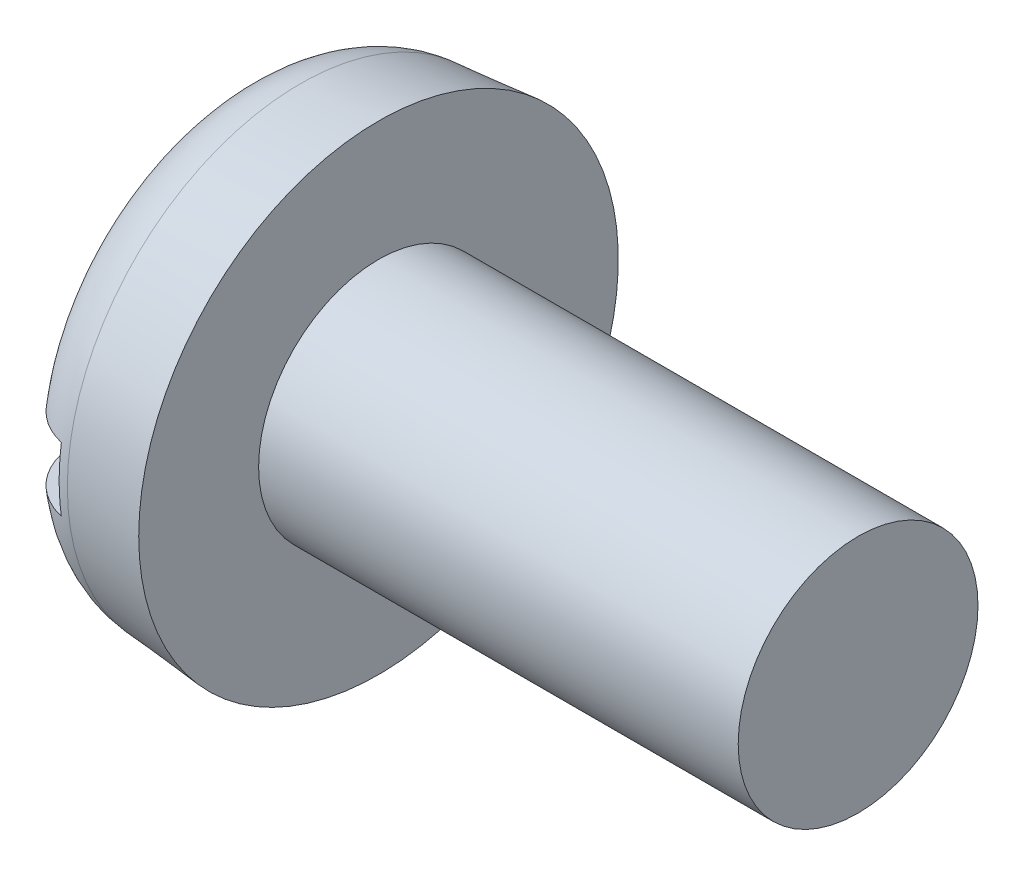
ISO-10303-21;
HEADER;
FILE_DESCRIPTION(('STEP AP214'),'2;1');
FILE_NAME('part.step','',(''),(''),'','','');
FILE_SCHEMA(('AUTOMOTIVE_DESIGN { 1 0 10303 214 1 1 1 1 }'));
ENDSEC;
DATA;
#1=APPLICATION_CONTEXT('core data for automotive mechanical design processes');
#2=APPLICATION_PROTOCOL_DEFINITION('international standard','automotive_design',2000,#1);
#3=PRODUCT_CONTEXT('',#1,'mechanical');
#4=PRODUCT('Part','Part','',(#3));
#5=PRODUCT_RELATED_PRODUCT_CATEGORY('part','',(#4));
#6=PRODUCT_DEFINITION_FORMATION('','',#4);
#7=PRODUCT_DEFINITION_CONTEXT('part definition',#1,'design');
#8=PRODUCT_DEFINITION('design','',#6,#7);
#9=PRODUCT_DEFINITION_SHAPE('','',#8);
#10=(LENGTH_UNIT() NAMED_UNIT(*) SI_UNIT(.MILLI.,.METRE.));
#11=(NAMED_UNIT(*) PLANE_ANGLE_UNIT() SI_UNIT($,.RADIAN.));
#12=(NAMED_UNIT(*) SI_UNIT($,.STERADIAN.) SOLID_ANGLE_UNIT());
#13=UNCERTAINTY_MEASURE_WITH_UNIT(LENGTH_MEASURE(1.E-05),#10,'distance_accuracy_value','');
#14=(GEOMETRIC_REPRESENTATION_CONTEXT(3) GLOBAL_UNCERTAINTY_ASSIGNED_CONTEXT((#13)) GLOBAL_UNIT_ASSIGNED_CONTEXT((#10,
#11,#12)) REPRESENTATION_CONTEXT('',''));
#15=CARTESIAN_POINT('',(0.,0.,0.));
#16=DIRECTION('',(0.,0.,1.));
#17=DIRECTION('',(1.,0.,0.));
#18=AXIS2_PLACEMENT_3D('',#15,#16,#17);
#19=CARTESIAN_POINT('',(0.,0.,0.));
#20=DIRECTION('',(-1.,0.,0.));
#21=DIRECTION('',(0.,0.,1.));
#22=AXIS2_PLACEMENT_3D('',#19,#20,#21);
#23=PLANE('',#22);
#24=DIRECTION('',(0.,0.,-1.));
#25=VECTOR('',#24,1.);
#26=CARTESIAN_POINT('',(0.,0.799999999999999,6.));
#27=LINE('',#26,#25);
#28=CARTESIAN_POINT('',(0.,0.799999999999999,3.9555566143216));
#29=VERTEX_POINT('',#28);
#30=CARTESIAN_POINT('',(0.,0.799999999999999,-3.9555566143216));
#31=VERTEX_POINT('',#30);
#32=EDGE_CURVE('E85',#29,#31,#27,.T.);
#33=ORIENTED_EDGE('',*,*,#32,.F.);
#34=CARTESIAN_POINT('',(0.,0.,0.));
#35=DIRECTION('',(-1.,0.,0.));
#36=DIRECTION('',(0.,0.,1.));
#37=AXIS2_PLACEMENT_3D('',#34,#35,#36);
#38=CIRCLE('',#37,4.03564469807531);
#39=EDGE_CURVE('E91',#29,#31,#38,.T.);
#40=ORIENTED_EDGE('',*,*,#39,.T.);
#41=EDGE_LOOP('',(#33,#40));
#42=FACE_BOUND('',#41,.T.);
#43=ADVANCED_FACE('F32',(#42),#23,.T.);
#44=CARTESIAN_POINT('',(-25.4,0.,0.));
#45=DIRECTION('',(-1.,0.,0.));
#46=DIRECTION('',(0.,0.,1.));
#47=AXIS2_PLACEMENT_3D('',#44,#45,#46);
#48=CYLINDRICAL_SURFACE('',#47,3.);
#49=CARTESIAN_POINT('',(15.6,0.,0.));
#50=DIRECTION('',(-1.,0.,0.));
#51=DIRECTION('',(0.,0.,1.));
#52=AXIS2_PLACEMENT_3D('',#49,#50,#51);
#53=CIRCLE('',#52,3.);
#54=CARTESIAN_POINT('',(15.6,0.,3.));
#55=VERTEX_POINT('',#54);
#56=EDGE_CURVE('E92',#55,#55,#53,.T.);
#57=ORIENTED_EDGE('',*,*,#56,.T.);
#58=EDGE_LOOP('',(#57));
#59=FACE_BOUND('',#58,.T.);
#60=CARTESIAN_POINT('',(3.6,0.,0.));
#61=DIRECTION('',(-1.,0.,0.));
#62=DIRECTION('',(0.,0.,1.));
#63=AXIS2_PLACEMENT_3D('',#60,#61,#62);
#64=CIRCLE('',#63,3.);
#65=CARTESIAN_POINT('',(3.6,0.,3.));
#66=VERTEX_POINT('',#65);
#67=EDGE_CURVE('E149',#66,#66,#64,.T.);
#68=ORIENTED_EDGE('',*,*,#67,.F.);
#69=EDGE_LOOP('',(#68));
#70=FACE_BOUND('',#69,.T.);
#71=ADVANCED_FACE('F137',(#59,#70),#48,.T.);
#72=CARTESIAN_POINT('',(15.6,3.,0.));
#73=DIRECTION('',(1.,0.,0.));
#74=DIRECTION('',(0.,0.,-1.));
#75=AXIS2_PLACEMENT_3D('',#72,#73,#74);
#76=PLANE('',#75);
#77=ORIENTED_EDGE('',*,*,#56,.F.);
#78=EDGE_LOOP('',(#77));
#79=FACE_BOUND('',#78,.T.);
#80=ADVANCED_FACE('F135',(#79),#76,.T.);
#81=DIRECTION('',(0.,0.,1.));
#82=VECTOR('',#81,1.);
#83=CARTESIAN_POINT('',(0.,-0.799999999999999,-6.));
#84=LINE('',#83,#82);
#85=CARTESIAN_POINT('',(0.,-0.799999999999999,-3.9555566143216));
#86=VERTEX_POINT('',#85);
#87=CARTESIAN_POINT('',(0.,-0.800000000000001,3.9555566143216));
#88=VERTEX_POINT('',#87);
#89=EDGE_CURVE('E76',#86,#88,#84,.T.);
#90=ORIENTED_EDGE('',*,*,#89,.F.);
#91=EDGE_CURVE('E83',#86,#88,#38,.T.);
#92=ORIENTED_EDGE('',*,*,#91,.T.);
#93=EDGE_LOOP('',(#90,#92));
#94=FACE_BOUND('',#93,.T.);
#95=ADVANCED_FACE('F82',(#94),#23,.T.);
#96=CARTESIAN_POINT('',(0.,0.,0.));
#97=DIRECTION('',(1.,0.,0.));
#98=DIRECTION('',(0.,0.,-1.));
#99=AXIS2_PLACEMENT_3D('',#96,#97,#98);
#100=CONICAL_SURFACE('',#99,5.68504081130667,0.0872664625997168);
#101=CARTESIAN_POINT('',(1.64311966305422,0.,0.));
#102=DIRECTION('',(-1.,0.,0.));
#103=DIRECTION('',(0.,0.,1.));
#104=AXIS2_PLACEMENT_3D('',#101,#102,#103);
#105=CIRCLE('',#104,5.82879515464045);
#106=CARTESIAN_POINT('',(1.64311966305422,0.,5.82879515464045));
#107=VERTEX_POINT('',#106);
#108=EDGE_CURVE('E95',#107,#107,#105,.F.);
#109=ORIENTED_EDGE('',*,*,#108,.T.);
#110=EDGE_LOOP('',(#109));
#111=FACE_BOUND('',#110,.T.);
#112=CARTESIAN_POINT('',(3.6,0.,0.));
#113=DIRECTION('',(-1.,0.,0.));
#114=DIRECTION('',(0.,0.,1.));
#115=AXIS2_PLACEMENT_3D('',#112,#113,#114);
#116=CIRCLE('',#115,6.);
#117=CARTESIAN_POINT('',(3.6,0.,6.));
#118=VERTEX_POINT('',#117);
#119=EDGE_CURVE('E97',#118,#118,#116,.T.);
#120=ORIENTED_EDGE('',*,*,#119,.T.);
#121=EDGE_LOOP('',(#120));
#122=FACE_BOUND('',#121,.T.);
#123=ADVANCED_FACE('F128',(#111,#122),#100,.T.);
#124=CARTESIAN_POINT('',(3.6,3.,0.));
#125=DIRECTION('',(-1.,0.,0.));
#126=DIRECTION('',(0.,0.,1.));
#127=AXIS2_PLACEMENT_3D('',#124,#125,#126);
#128=PLANE('',#127);
#129=ORIENTED_EDGE('',*,*,#119,.F.);
#130=EDGE_LOOP('',(#129));
#131=FACE_BOUND('',#130,.T.);
#132=ORIENTED_EDGE('',*,*,#67,.T.);
#133=EDGE_LOOP('',(#132));
#134=FACE_BOUND('',#133,.T.);
#135=ADVANCED_FACE('F124',(#131,#134),#128,.F.);
#136=CARTESIAN_POINT('',(1.8,0.,0.));
#137=DIRECTION('',(-1.,0.,0.));
#138=DIRECTION('',(0.,0.,1.));
#139=AXIS2_PLACEMENT_3D('',#136,#137,#138);
#140=TOROIDAL_SURFACE('',#139,4.03564469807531,1.8);
#141=CARTESIAN_POINT('',(0.540762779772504,0.799999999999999,-5.2613759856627));
#142=CARTESIAN_POINT('',(0.612348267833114,0.799999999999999,-5.33226007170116));
#143=CARTESIAN_POINT('',(0.689931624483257,0.799999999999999,-5.3971854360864));
#144=CARTESIAN_POINT('',(0.854947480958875,0.799999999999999,-5.51316161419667));
#145=CARTESIAN_POINT('',(0.94239068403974,0.799999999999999,-5.56419714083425));
#146=CARTESIAN_POINT('',(1.12461220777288,0.799999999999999,-5.650821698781));
#147=CARTESIAN_POINT('',(1.21938917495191,0.799999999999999,-5.6864135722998));
#148=CARTESIAN_POINT('',(1.41356630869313,0.799999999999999,-5.74109194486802));
#149=CARTESIAN_POINT('',(1.51296538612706,0.799999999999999,-5.76018231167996));
#150=CARTESIAN_POINT('',(1.71313899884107,0.799999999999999,-5.78126121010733));
#151=CARTESIAN_POINT('',(1.81390602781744,0.799999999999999,-5.78332104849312));
#152=CARTESIAN_POINT('',(2.01435310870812,0.799999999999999,-5.77046455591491));
#153=CARTESIAN_POINT('',(2.11403314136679,0.799999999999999,-5.75554792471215));
#154=CARTESIAN_POINT('',(2.309314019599,0.799999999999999,-5.70921606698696));
#155=CARTESIAN_POINT('',(2.40492104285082,0.799999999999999,-5.67782686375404));
#156=CARTESIAN_POINT('',(2.58952927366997,0.799999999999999,-5.59948776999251));
#157=CARTESIAN_POINT('',(2.67853045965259,0.799999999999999,-5.55253782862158));
#158=CARTESIAN_POINT('',(2.84769451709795,0.799999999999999,-5.44428887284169));
#159=CARTESIAN_POINT('',(2.92783091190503,0.799999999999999,-5.38294849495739));
#160=CARTESIAN_POINT('',(3.07676159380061,0.799999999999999,-5.24777626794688));
#161=CARTESIAN_POINT('',(3.1455556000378,0.799999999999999,-5.17394410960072));
#162=CARTESIAN_POINT('',(3.27042510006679,0.799999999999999,-5.01531035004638));
#163=CARTESIAN_POINT('',(3.32640120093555,0.799999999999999,-4.93043053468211));
#164=CARTESIAN_POINT('',(3.4235057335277,0.799999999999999,-4.75256933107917));
#165=CARTESIAN_POINT('',(3.46463341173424,0.799999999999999,-4.65958753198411));
#166=CARTESIAN_POINT('',(3.53144158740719,0.799999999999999,-4.46694835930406));
#167=CARTESIAN_POINT('',(3.55692557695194,0.799999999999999,-4.36722286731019));
#168=CARTESIAN_POINT('',(3.59108701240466,0.799999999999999,-4.16493761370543));
#169=CARTESIAN_POINT('',(3.59976314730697,0.799999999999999,-4.06237763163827));
#170=CARTESIAN_POINT('',(3.60023112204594,0.799999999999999,-3.85550711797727));
#171=CARTESIAN_POINT('',(3.59173848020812,0.799999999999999,-3.75119596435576));
#172=CARTESIAN_POINT('',(3.55768438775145,0.799999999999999,-3.54539907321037));
#173=CARTESIAN_POINT('',(3.53212117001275,0.799999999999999,-3.44391362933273));
#174=CARTESIAN_POINT('',(3.46412322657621,0.799999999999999,-3.24471369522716));
#175=CARTESIAN_POINT('',(3.42139292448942,0.799999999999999,-3.14710004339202));
#176=CARTESIAN_POINT('',(3.32030286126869,0.799999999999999,-2.96031799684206));
#177=CARTESIAN_POINT('',(3.26194098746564,0.799999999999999,-2.87115074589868));
#178=CARTESIAN_POINT('',(3.13053846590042,0.799999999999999,-2.70303664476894));
#179=CARTESIAN_POINT('',(3.05736818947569,0.799999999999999,-2.62419095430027));
#180=CARTESIAN_POINT('',(2.89859048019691,0.799999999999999,-2.48017518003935));
#181=CARTESIAN_POINT('',(2.81298317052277,0.799999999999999,-2.41500496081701));
#182=CARTESIAN_POINT('',(2.6334271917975,0.799999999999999,-2.30187272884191));
#183=CARTESIAN_POINT('',(2.53967929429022,0.799999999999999,-2.25359299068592));
#184=CARTESIAN_POINT('',(2.34507363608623,0.799999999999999,-2.17455467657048));
#185=CARTESIAN_POINT('',(2.24421969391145,0.799999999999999,-2.14378676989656));
#186=CARTESIAN_POINT('',(2.04443930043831,0.799999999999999,-2.10254396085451));
#187=CARTESIAN_POINT('',(1.94573097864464,0.799999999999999,-2.09101175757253));
#188=CARTESIAN_POINT('',(1.74783816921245,0.799999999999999,-2.08550669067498));
#189=CARTESIAN_POINT('',(1.64865381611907,0.799999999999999,-2.09152912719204));
#190=CARTESIAN_POINT('',(1.45702700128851,0.799999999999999,-2.12018138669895));
#191=CARTESIAN_POINT('',(1.36447664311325,0.799999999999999,-2.14209986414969));
#192=CARTESIAN_POINT('',(1.18420660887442,0.799999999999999,-2.20075771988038));
#193=CARTESIAN_POINT('',(1.09648771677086,0.799999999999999,-2.23749949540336));
#194=CARTESIAN_POINT('',(0.925723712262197,0.799999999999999,-2.32557805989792));
#195=CARTESIAN_POINT('',(0.842868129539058,0.799999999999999,-2.37728131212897));
#196=CARTESIAN_POINT('',(0.686362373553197,0.799999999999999,-2.493116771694));
#197=CARTESIAN_POINT('',(0.612714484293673,0.799999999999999,-2.55725205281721));
#198=CARTESIAN_POINT('',(0.472161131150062,0.799999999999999,-2.70027682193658));
#199=CARTESIAN_POINT('',(0.405916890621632,0.799999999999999,-2.77981681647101));
#200=CARTESIAN_POINT('',(0.287173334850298,0.799999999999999,-2.9485732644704));
#201=CARTESIAN_POINT('',(0.234676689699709,0.799999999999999,-3.03779159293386));
#202=CARTESIAN_POINT('',(0.143214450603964,0.799999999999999,-3.22677844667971));
#203=CARTESIAN_POINT('',(0.104782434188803,0.799999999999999,-3.32680584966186));
#204=CARTESIAN_POINT('',(0.0452446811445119,0.799999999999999,-3.5318922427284));
#205=CARTESIAN_POINT('',(0.0241387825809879,0.799999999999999,-3.63695118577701));
#206=CARTESIAN_POINT('',(-1.12670491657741E-05,0.799999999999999,-3.84916824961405));
#207=CARTESIAN_POINT('',(-0.00304965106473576,0.799999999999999,-3.95632702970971));
#208=CARTESIAN_POINT('',(0.00921984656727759,0.799999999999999,-4.16962319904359));
#209=CARTESIAN_POINT('',(0.0245310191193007,0.799999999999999,-4.27576040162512));
#210=CARTESIAN_POINT('',(0.0728327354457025,0.799999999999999,-4.48216521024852));
#211=CARTESIAN_POINT('',(0.105541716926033,0.799999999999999,-4.58249883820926));
#212=CARTESIAN_POINT('',(0.187634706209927,0.799999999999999,-4.77599767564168));
#213=CARTESIAN_POINT('',(0.236996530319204,0.799999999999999,-4.86917222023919));
#214=CARTESIAN_POINT('',(0.329466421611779,0.799999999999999,-5.01228034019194));
#215=CARTESIAN_POINT('',(0.367921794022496,0.799999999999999,-5.06527765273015));
#216=CARTESIAN_POINT('',(0.450329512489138,0.799999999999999,-5.16681267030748));
#217=CARTESIAN_POINT('',(0.494281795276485,0.799999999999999,-5.21535042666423));
#218=CARTESIAN_POINT('',(0.540762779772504,0.799999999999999,-5.2613759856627));
#219=B_SPLINE_CURVE_WITH_KNOTS('',3,(#141,#142,#143,#144,#145,#146,#147,#148,#149,#150,#151,
#152,#153,#154,#155,#156,#157,#158,#159,#160,#161,#162,#163,#164,#165,#166,#167,#168,#169,#170,
#171,#172,#173,#174,#175,#176,#177,#178,#179,#180,#181,#182,#183,#184,#185,#186,#187,#188,#189,
#190,#191,#192,#193,#194,#195,#196,#197,#198,#199,#200,#201,#202,#203,#204,#205,#206,#207,#208,
#209,#210,#211,#212,#213,#214,#215,#216,#217,#218),.UNSPECIFIED.,.T.,.F.,(4,2,2,2,2,2,2,2,2,2,2,
2,2,2,2,2,2,2,2,2,2,2,2,2,2,2,2,2,2,2,2,2,2,2,2,2,2,2,4),(0.,0.301990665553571,
0.604312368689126,0.906578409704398,1.20877358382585,1.50970282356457,1.81063738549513,
2.11109795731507,2.41155951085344,2.71289551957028,3.01423898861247,3.31784547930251,
3.6214673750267,3.92882908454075,4.23621476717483,4.54873547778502,4.86128854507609,
5.17947093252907,5.49769634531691,5.81883829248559,6.13997705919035,6.45470120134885,
6.76925749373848,7.06587349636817,7.36241009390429,7.64643650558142,7.93050886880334,
8.22223277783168,8.51402890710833,8.8231740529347,9.13237919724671,9.45232886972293,
9.77227555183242,10.0923243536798,10.4124305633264,10.7275071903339,11.042165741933,
11.2382527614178,11.4343375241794),.UNSPECIFIED.);
#220=CARTESIAN_POINT('',(1.4,0.799999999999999,-5.73510972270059));
#221=VERTEX_POINT('',#220);
#222=EDGE_CURVE('E11',#31,#221,#219,.T.);
#223=ORIENTED_EDGE('',*,*,#222,.F.);
#224=ORIENTED_EDGE('',*,*,#39,.F.);
#225=CARTESIAN_POINT('',(0.836266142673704,0.799999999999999,2.3847675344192));
#226=CARTESIAN_POINT('',(0.917616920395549,0.799999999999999,2.33037611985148));
#227=CARTESIAN_POINT('',(1.00338812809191,0.799999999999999,2.28250940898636));
#228=CARTESIAN_POINT('',(1.18171371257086,0.799999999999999,2.20157945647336));
#229=CARTESIAN_POINT('',(1.27427138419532,0.799999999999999,2.16852346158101));
#230=CARTESIAN_POINT('',(1.46387360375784,0.799999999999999,2.11861651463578));
#231=CARTESIAN_POINT('',(1.56092620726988,0.799999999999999,2.10179593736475));
#232=CARTESIAN_POINT('',(1.75645828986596,0.799999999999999,2.08531619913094));
#233=CARTESIAN_POINT('',(1.85493729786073,0.799999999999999,2.08565149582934));
#234=CARTESIAN_POINT('',(2.04724581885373,0.799999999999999,2.10316628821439));
#235=CARTESIAN_POINT('',(2.1411242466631,0.799999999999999,2.11981673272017));
#236=CARTESIAN_POINT('',(2.32483197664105,0.799999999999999,2.16840533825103));
#237=CARTESIAN_POINT('',(2.41466058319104,0.799999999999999,2.20034611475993));
#238=CARTESIAN_POINT('',(2.58937479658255,0.799999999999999,2.27883470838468));
#239=CARTESIAN_POINT('',(2.67416016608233,0.799999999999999,2.32560484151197));
#240=CARTESIAN_POINT('',(2.83527159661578,0.799999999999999,2.43194790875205));
#241=CARTESIAN_POINT('',(2.91159566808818,0.799999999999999,2.4915238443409));
#242=CARTESIAN_POINT('',(3.05833847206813,0.799999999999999,2.62557742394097));
#243=CARTESIAN_POINT('',(3.12814463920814,0.799999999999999,2.70072607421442));
#244=CARTESIAN_POINT('',(3.25476371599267,0.799999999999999,2.86127427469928));
#245=CARTESIAN_POINT('',(3.31157384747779,0.799999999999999,2.94667601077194));
#246=CARTESIAN_POINT('',(3.41282909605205,0.799999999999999,3.12914373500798));
#247=CARTESIAN_POINT('',(3.4566732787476,0.799999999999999,3.22654397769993));
#248=CARTESIAN_POINT('',(3.52749042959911,0.799999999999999,3.42730182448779));
#249=CARTESIAN_POINT('',(3.55446245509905,0.799999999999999,3.53065976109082));
#250=CARTESIAN_POINT('',(3.59074777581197,0.799999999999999,3.74099682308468));
#251=CARTESIAN_POINT('',(3.59996828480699,0.799999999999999,3.84799201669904));
#252=CARTESIAN_POINT('',(3.60003154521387,0.799999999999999,4.06199242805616));
#253=CARTESIAN_POINT('',(3.59087543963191,0.799999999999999,4.16899764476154));
#254=CARTESIAN_POINT('',(3.5545508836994,0.799999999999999,4.37828946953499));
#255=CARTESIAN_POINT('',(3.5276490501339,0.799999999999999,4.48062230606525));
#256=CARTESIAN_POINT('',(3.45672417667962,0.799999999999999,4.67917518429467));
#257=CARTESIAN_POINT('',(3.41270279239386,0.799999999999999,4.77539581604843));
#258=CARTESIAN_POINT('',(3.30967441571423,0.799999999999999,4.95711293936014));
#259=CARTESIAN_POINT('',(3.2509575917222,0.799999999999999,5.04277397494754));
#260=CARTESIAN_POINT('',(3.11977209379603,0.799999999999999,5.20282644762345));
#261=CARTESIAN_POINT('',(3.04730458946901,0.799999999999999,5.27721884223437));
#262=CARTESIAN_POINT('',(2.89186263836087,0.799999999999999,5.41145672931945));
#263=CARTESIAN_POINT('',(2.80906226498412,0.799999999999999,5.47150384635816));
#264=CARTESIAN_POINT('',(2.63447307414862,0.799999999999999,5.57667826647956));
#265=CARTESIAN_POINT('',(2.54268479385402,0.799999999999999,5.62180646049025));
#266=CARTESIAN_POINT('',(2.35372245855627,0.799999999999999,5.69541178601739));
#267=CARTESIAN_POINT('',(2.25661170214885,0.799999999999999,5.72405148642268));
#268=CARTESIAN_POINT('',(2.05894963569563,0.799999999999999,5.76452632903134));
#269=CARTESIAN_POINT('',(1.95839844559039,0.799999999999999,5.77636205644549));
#270=CARTESIAN_POINT('',(1.75726466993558,0.799999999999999,5.78286013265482));
#271=CARTESIAN_POINT('',(1.65668492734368,0.799999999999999,5.77761084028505));
#272=CARTESIAN_POINT('',(1.45783846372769,0.799999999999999,5.75028865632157));
#273=CARTESIAN_POINT('',(1.35957171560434,0.799999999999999,5.72821596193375));
#274=CARTESIAN_POINT('',(1.16819371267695,0.799999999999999,5.66791633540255));
#275=CARTESIAN_POINT('',(1.07507939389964,0.799999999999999,5.62969912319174));
#276=CARTESIAN_POINT('',(0.896555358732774,0.799999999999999,5.53823241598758));
#277=CARTESIAN_POINT('',(0.811145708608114,0.799999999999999,5.4849827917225));
#278=CARTESIAN_POINT('',(0.650082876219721,0.799999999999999,5.36476593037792));
#279=CARTESIAN_POINT('',(0.574468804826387,0.799999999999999,5.29774630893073));
#280=CARTESIAN_POINT('',(0.435451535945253,0.799999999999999,5.15205983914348));
#281=CARTESIAN_POINT('',(0.372048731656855,0.799999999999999,5.07339261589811));
#282=CARTESIAN_POINT('',(0.258650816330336,0.799999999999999,4.90594446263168));
#283=CARTESIAN_POINT('',(0.208774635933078,0.799999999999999,4.81708301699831));
#284=CARTESIAN_POINT('',(0.124428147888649,0.799999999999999,4.63233098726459));
#285=CARTESIAN_POINT('',(0.0899587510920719,0.799999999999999,4.53643998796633));
#286=CARTESIAN_POINT('',(0.0368868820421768,0.799999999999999,4.33899079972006));
#287=CARTESIAN_POINT('',(0.0185025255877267,0.799999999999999,4.23737401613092));
#288=CARTESIAN_POINT('',(-0.00125734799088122,0.799999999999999,4.03250747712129));
#289=CARTESIAN_POINT('',(-0.00263209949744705,0.799999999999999,3.9292576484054));
#290=CARTESIAN_POINT('',(0.0116307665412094,0.799999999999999,3.72214563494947));
#291=CARTESIAN_POINT('',(0.0275632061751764,0.799999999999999,3.61830377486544));
#292=CARTESIAN_POINT('',(0.0763335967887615,0.799999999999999,3.41464106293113));
#293=CARTESIAN_POINT('',(0.10917724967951,0.799999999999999,3.31482157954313));
#294=CARTESIAN_POINT('',(0.191511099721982,0.799999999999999,3.12021092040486));
#295=CARTESIAN_POINT('',(0.241286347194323,0.799999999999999,3.02554040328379));
#296=CARTESIAN_POINT('',(0.355915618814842,0.799999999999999,2.8458978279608));
#297=CARTESIAN_POINT('',(0.420755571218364,0.799999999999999,2.76091682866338));
#298=CARTESIAN_POINT('',(0.543269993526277,0.799999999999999,2.62572980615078));
#299=CARTESIAN_POINT('',(0.597683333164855,0.799999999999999,2.57253239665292));
#300=CARTESIAN_POINT('',(0.712598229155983,0.799999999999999,2.4731680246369));
#301=CARTESIAN_POINT('',(0.773099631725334,0.799999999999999,2.42700088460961));
#302=CARTESIAN_POINT('',(0.836266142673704,0.799999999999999,2.3847675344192));
#303=B_SPLINE_CURVE_WITH_KNOTS('',3,(#225,#226,#227,#228,#229,#230,#231,#232,#233,#234,#235,
#236,#237,#238,#239,#240,#241,#242,#243,#244,#245,#246,#247,#248,#249,#250,#251,#252,#253,#254,
#255,#256,#257,#258,#259,#260,#261,#262,#263,#264,#265,#266,#267,#268,#269,#270,#271,#272,#273,
#274,#275,#276,#277,#278,#279,#280,#281,#282,#283,#284,#285,#286,#287,#288,#289,#290,#291,#292,
#293,#294,#295,#296,#297,#298,#299,#300,#301,#302),.UNSPECIFIED.,.T.,.F.,(4,2,2,2,2,2,2,2,2,2,2,
2,2,2,2,2,2,2,2,2,2,2,2,2,2,2,2,2,2,2,2,2,2,2,2,2,2,2,4),(0.,0.293321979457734,
0.586787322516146,0.880800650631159,1.17471899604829,1.45941156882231,1.74415285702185,
2.03338255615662,2.32268012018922,2.62901646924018,2.93541824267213,3.25435495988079,
3.57330949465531,3.89392670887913,4.21452398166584,4.53041098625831,4.84626744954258,
5.1563211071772,5.46634840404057,5.77172128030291,6.0770759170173,6.37936593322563,
6.6816454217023,6.98236409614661,7.2830792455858,7.5836136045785,7.88415054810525,
8.18585270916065,8.48756458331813,8.79184901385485,9.09615143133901,9.40451898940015,
9.71290042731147,10.0266186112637,10.3404426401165,10.6598354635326,10.9789311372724,
11.2066928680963,11.43444884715),.UNSPECIFIED.);
#304=CARTESIAN_POINT('',(1.4,0.799999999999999,5.73510972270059));
#305=VERTEX_POINT('',#304);
#306=EDGE_CURVE('E109',#305,#29,#303,.T.);
#307=ORIENTED_EDGE('',*,*,#306,.F.);
#308=CARTESIAN_POINT('',(1.4,0.,0.));
#309=DIRECTION('',(-1.,0.,0.));
#310=DIRECTION('',(0.,0.,1.));
#311=AXIS2_PLACEMENT_3D('',#308,#309,#310);
#312=CIRCLE('',#311,5.79063757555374);
#313=CARTESIAN_POINT('',(1.4,-0.800000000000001,5.73510972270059));
#314=VERTEX_POINT('',#313);
#315=EDGE_CURVE('E103',#305,#314,#312,.F.);
#316=ORIENTED_EDGE('',*,*,#315,.T.);
#317=CARTESIAN_POINT('',(0.836266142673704,-0.8,2.3847675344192));
#318=CARTESIAN_POINT('',(0.748506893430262,-0.8,2.44345191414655));
#319=CARTESIAN_POINT('',(0.665766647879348,-0.8,2.50981960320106));
#320=CARTESIAN_POINT('',(0.512551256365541,-0.8,2.65561376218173));
#321=CARTESIAN_POINT('',(0.442099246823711,-0.8,2.73506432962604));
#322=CARTESIAN_POINT('',(0.315475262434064,-0.8,2.90443495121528));
#323=CARTESIAN_POINT('',(0.259280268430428,-0.8,2.99433778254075));
#324=CARTESIAN_POINT('',(0.162548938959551,-0.8,3.18215299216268));
#325=CARTESIAN_POINT('',(0.122006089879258,-0.8,3.28006201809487));
#326=CARTESIAN_POINT('',(0.0572425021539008,-0.8,3.4827212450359));
#327=CARTESIAN_POINT('',(0.0332676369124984,-0.8,3.58755021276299));
#328=CARTESIAN_POINT('',(0.00342578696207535,-0.8,3.79976969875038));
#329=CARTESIAN_POINT('',(-0.00244009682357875,-0.800000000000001,3.90716037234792));
#330=CARTESIAN_POINT('',(0.00425089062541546,-0.800000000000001,4.12040369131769));
#331=CARTESIAN_POINT('',(0.0166422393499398,-0.800000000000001,4.22626147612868));
#332=CARTESIAN_POINT('',(0.0593599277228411,-0.800000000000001,4.43429705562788));
#333=CARTESIAN_POINT('',(0.0896844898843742,-0.800000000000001,4.53647521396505));
#334=CARTESIAN_POINT('',(0.166811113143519,-0.800000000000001,4.73226366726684));
#335=CARTESIAN_POINT('',(0.21330327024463,-0.800000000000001,4.82599604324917));
#336=CARTESIAN_POINT('',(0.32162267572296,-0.800000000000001,5.00413844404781));
#337=CARTESIAN_POINT('',(0.383448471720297,-0.800000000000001,5.08854935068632));
#338=CARTESIAN_POINT('',(0.519544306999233,-0.800000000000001,5.24416143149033));
#339=CARTESIAN_POINT('',(0.593588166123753,-0.800000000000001,5.31556046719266));
#340=CARTESIAN_POINT('',(0.752739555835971,-0.800000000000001,5.44472836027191));
#341=CARTESIAN_POINT('',(0.837846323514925,-0.800000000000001,5.5024981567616));
#342=CARTESIAN_POINT('',(1.01558854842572,-0.800000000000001,5.60205300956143));
#343=CARTESIAN_POINT('',(1.10812041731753,-0.800000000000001,5.64402306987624));
#344=CARTESIAN_POINT('',(1.29895009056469,-0.800000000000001,5.71170590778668));
#345=CARTESIAN_POINT('',(1.39724763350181,-0.800000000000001,5.7374194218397));
#346=CARTESIAN_POINT('',(1.59606633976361,-0.800000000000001,5.77169733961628));
#347=CARTESIAN_POINT('',(1.69656671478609,-0.800000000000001,5.78038241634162));
#348=CARTESIAN_POINT('',(1.89759433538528,-0.800000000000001,5.78071120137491));
#349=CARTESIAN_POINT('',(1.99812158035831,-0.800000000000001,5.77235526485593));
#350=CARTESIAN_POINT('',(2.19609344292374,-0.800000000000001,5.73889133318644));
#351=CARTESIAN_POINT('',(2.29354498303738,-0.800000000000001,5.71382425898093));
#352=CARTESIAN_POINT('',(2.48286854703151,-0.800000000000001,5.64771711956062));
#353=CARTESIAN_POINT('',(2.57474056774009,-0.800000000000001,5.60667704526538));
#354=CARTESIAN_POINT('',(2.75051258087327,-0.800000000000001,5.50972539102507));
#355=CARTESIAN_POINT('',(2.8343959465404,-0.800000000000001,5.45378367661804));
#356=CARTESIAN_POINT('',(2.99165678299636,-0.800000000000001,5.32869697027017));
#357=CARTESIAN_POINT('',(3.06503402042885,-0.800000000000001,5.25955168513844));
#358=CARTESIAN_POINT('',(3.19973989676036,-0.800000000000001,5.10955333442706));
#359=CARTESIAN_POINT('',(3.26098586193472,-0.800000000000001,5.02862604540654));
#360=CARTESIAN_POINT('',(3.36919753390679,-0.800000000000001,4.85773374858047));
#361=CARTESIAN_POINT('',(3.41616259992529,-0.800000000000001,4.76776833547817));
#362=CARTESIAN_POINT('',(3.49507738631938,-0.800000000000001,4.5802716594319));
#363=CARTESIAN_POINT('',(3.52685014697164,-0.800000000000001,4.48266594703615));
#364=CARTESIAN_POINT('',(3.57383908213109,-0.800000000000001,4.28355151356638));
#365=CARTESIAN_POINT('',(3.58905405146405,-0.800000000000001,4.18204250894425));
#366=CARTESIAN_POINT('',(3.60277332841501,-0.800000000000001,3.97627512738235));
#367=CARTESIAN_POINT('',(3.60100695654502,-0.8,3.87199872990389));
#368=CARTESIAN_POINT('',(3.58032198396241,-0.8,3.66516328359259));
#369=CARTESIAN_POINT('',(3.56140169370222,-0.8,3.56260440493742));
#370=CARTESIAN_POINT('',(3.50655445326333,-0.8,3.3601262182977));
#371=CARTESIAN_POINT('',(3.47032341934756,-0.8,3.26028924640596));
#372=CARTESIAN_POINT('',(3.38182060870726,-0.8,3.06798854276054));
#373=CARTESIAN_POINT('',(3.32954675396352,-0.8,2.97552576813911));
#374=CARTESIAN_POINT('',(3.20964725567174,-0.8,2.79948120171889));
#375=CARTESIAN_POINT('',(3.14184223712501,-0.8,2.71602141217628));
#376=CARTESIAN_POINT('',(2.99302219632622,-0.8,2.56181483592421));
#377=CARTESIAN_POINT('',(2.91200632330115,-0.8,2.49106886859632));
#378=CARTESIAN_POINT('',(2.73997760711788,-0.8,2.36551639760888));
#379=CARTESIAN_POINT('',(2.64910309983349,-0.8,2.31052086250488));
#380=CARTESIAN_POINT('',(2.4590409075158,-0.8,2.21753014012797));
#381=CARTESIAN_POINT('',(2.35985743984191,-0.8,2.17952638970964));
#382=CARTESIAN_POINT('',(2.16147923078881,-0.8,2.12383562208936));
#383=CARTESIAN_POINT('',(2.06255196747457,-0.8,2.10519696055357));
#384=CARTESIAN_POINT('',(1.86294330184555,-0.8,2.08580594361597));
#385=CARTESIAN_POINT('',(1.76226208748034,-0.8,2.08505168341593));
#386=CARTESIAN_POINT('',(1.56749167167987,-0.8,2.1010369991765));
#387=CARTESIAN_POINT('',(1.47332742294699,-0.8,2.11688981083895));
#388=CARTESIAN_POINT('',(1.28901868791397,-0.8,2.16397488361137));
#389=CARTESIAN_POINT('',(1.19886974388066,-0.8,2.19518960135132));
#390=CARTESIAN_POINT('',(1.0638315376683,-0.8,2.25452352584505));
#391=CARTESIAN_POINT('',(1.01673933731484,-0.8,2.27777851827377));
#392=CARTESIAN_POINT('',(0.924773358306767,-0.8,2.32831196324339));
#393=CARTESIAN_POINT('',(0.879899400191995,-0.8,2.35559008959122));
#394=CARTESIAN_POINT('',(0.836266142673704,-0.8,2.3847675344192));
#395=B_SPLINE_CURVE_WITH_KNOTS('',3,(#317,#318,#319,#320,#321,#322,#323,#324,#325,#326,#327,
#328,#329,#330,#331,#332,#333,#334,#335,#336,#337,#338,#339,#340,#341,#342,#343,#344,#345,#346,
#347,#348,#349,#350,#351,#352,#353,#354,#355,#356,#357,#358,#359,#360,#361,#362,#363,#364,#365,
#366,#367,#368,#369,#370,#371,#372,#373,#374,#375,#376,#377,#378,#379,#380,#381,#382,#383,#384,
#385,#386,#387,#388,#389,#390,#391,#392,#393,#394),.UNSPECIFIED.,.T.,.F.,(4,2,2,2,2,2,2,2,2,2,2,
2,2,2,2,2,2,2,2,2,2,2,2,2,2,2,2,2,2,2,2,2,2,2,2,2,2,2,4),(0.,0.316518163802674,
0.633625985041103,0.950218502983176,1.2666791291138,1.58774070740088,1.90882180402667,
2.22700979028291,2.54516624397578,2.8575328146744,3.16986980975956,3.47696670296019,
3.78404242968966,4.08740155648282,4.39074693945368,4.69193476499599,4.99311631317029,
5.29356304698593,5.59400995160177,5.89506910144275,6.19613493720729,6.49918680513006,
6.80225226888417,7.10876667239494,7.41530338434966,7.72673423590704,8.03819576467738,
8.35534173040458,8.6725287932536,8.99358246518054,9.31465682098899,9.63169865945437,
9.94858054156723,10.2490245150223,10.549436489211,10.8345871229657,11.1194128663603,
11.276796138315,11.4341666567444),.UNSPECIFIED.);
#396=EDGE_CURVE('E90',#88,#314,#395,.T.);
#397=ORIENTED_EDGE('',*,*,#396,.F.);
#398=ORIENTED_EDGE('',*,*,#91,.F.);
#399=CARTESIAN_POINT('',(0.540762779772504,-0.799999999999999,-5.2613759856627));
#400=CARTESIAN_POINT('',(0.46800256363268,-0.799999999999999,-5.18931554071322));
#401=CARTESIAN_POINT('',(0.401331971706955,-0.799999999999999,-5.11098969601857));
#402=CARTESIAN_POINT('',(0.282092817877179,-0.799999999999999,-4.94415021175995));
#403=CARTESIAN_POINT('',(0.229543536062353,-0.799999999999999,-4.85562287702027));
#404=CARTESIAN_POINT('',(0.140058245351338,-0.799999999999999,-4.67111833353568));
#405=CARTESIAN_POINT('',(0.103104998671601,-0.799999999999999,-4.57514948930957));
#406=CARTESIAN_POINT('',(0.0456444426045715,-0.799999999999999,-4.37844736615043));
#407=CARTESIAN_POINT('',(0.0251330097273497,-0.799999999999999,-4.27771528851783));
#408=CARTESIAN_POINT('',(0.000807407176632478,-0.799999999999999,-4.07306902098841));
#409=CARTESIAN_POINT('',(-0.00280970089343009,-0.799999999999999,-3.96913144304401));
#410=CARTESIAN_POINT('',(0.00712688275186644,-0.799999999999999,-3.76207815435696));
#411=CARTESIAN_POINT('',(0.0206829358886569,-0.8,-3.65896255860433));
#412=CARTESIAN_POINT('',(0.0648595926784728,-0.8,-3.45448287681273));
#413=CARTESIAN_POINT('',(0.0957869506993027,-0.8,-3.35318504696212));
#414=CARTESIAN_POINT('',(0.173966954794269,-0.8,-3.15709227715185));
#415=CARTESIAN_POINT('',(0.221221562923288,-0.8,-3.06229812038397));
#416=CARTESIAN_POINT('',(0.331523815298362,-0.8,-2.8805427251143));
#417=CARTESIAN_POINT('',(0.394784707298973,-0.8,-2.79371074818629));
#418=CARTESIAN_POINT('',(0.535080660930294,-0.8,-2.63196239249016));
#419=CARTESIAN_POINT('',(0.612117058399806,-0.8,-2.5570471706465));
#420=CARTESIAN_POINT('',(0.777363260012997,-0.8,-2.42207446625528));
#421=CARTESIAN_POINT('',(0.865488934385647,-0.8,-2.36191424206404));
#422=CARTESIAN_POINT('',(1.05097305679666,-0.8,-2.25807126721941));
#423=CARTESIAN_POINT('',(1.1483280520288,-0.8,-2.21438238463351));
#424=CARTESIAN_POINT('',(1.34472607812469,-0.8,-2.14709500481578));
#425=CARTESIAN_POINT('',(1.44348146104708,-0.8,-2.12265879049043));
#426=CARTESIAN_POINT('',(1.64375523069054,-0.8,-2.09184121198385));
#427=CARTESIAN_POINT('',(1.74527230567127,-0.8,-2.08545142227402));
#428=CARTESIAN_POINT('',(1.94205144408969,-0.8,-2.09089422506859));
#429=CARTESIAN_POINT('',(2.03734311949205,-0.8,-2.1017185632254));
#430=CARTESIAN_POINT('',(2.22475371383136,-0.8,-2.1391955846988));
#431=CARTESIAN_POINT('',(2.31687240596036,-0.8,-2.16584939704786));
#432=CARTESIAN_POINT('',(2.49568716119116,-0.8,-2.23389898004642));
#433=CARTESIAN_POINT('',(2.58237134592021,-0.8,-2.27532580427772));
#434=CARTESIAN_POINT('',(2.74807422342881,-0.8,-2.37138684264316));
#435=CARTESIAN_POINT('',(2.82709115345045,-0.8,-2.42602408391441));
#436=CARTESIAN_POINT('',(2.9799165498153,-0.8,-2.55022645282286));
#437=CARTESIAN_POINT('',(3.05318434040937,-0.8,-2.6204569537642));
#438=CARTESIAN_POINT('',(3.18755425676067,-0.8,-2.77172635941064));
#439=CARTESIAN_POINT('',(3.24865355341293,-0.8,-2.85276777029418));
#440=CARTESIAN_POINT('',(3.35979277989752,-0.8,-3.02754470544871));
#441=CARTESIAN_POINT('',(3.40917690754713,-0.8,-3.1216981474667));
#442=CARTESIAN_POINT('',(3.49164209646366,-0.8,-3.31689856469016));
#443=CARTESIAN_POINT('',(3.52472176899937,-0.8,-3.41794612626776));
#444=CARTESIAN_POINT('',(3.57383047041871,-0.8,-3.62528781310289));
#445=CARTESIAN_POINT('',(3.58966846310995,-0.8,-3.73162733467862));
#446=CARTESIAN_POINT('',(3.60302482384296,-0.8,-3.94545563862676));
#447=CARTESIAN_POINT('',(3.60054405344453,-0.799999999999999,-4.05294436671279));
#448=CARTESIAN_POINT('',(3.57730809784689,-0.799999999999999,-4.26456838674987));
#449=CARTESIAN_POINT('',(3.5567824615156,-0.799999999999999,-4.36872882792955));
#450=CARTESIAN_POINT('',(3.49820144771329,-0.799999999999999,-4.57200098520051));
#451=CARTESIAN_POINT('',(3.46014775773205,-0.799999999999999,-4.67111318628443));
#452=CARTESIAN_POINT('',(3.36835841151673,-0.799999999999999,-4.85952398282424));
#453=CARTESIAN_POINT('',(3.31492535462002,-0.799999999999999,-4.94897001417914));
#454=CARTESIAN_POINT('',(3.19357222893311,-0.799999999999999,-5.1174283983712));
#455=CARTESIAN_POINT('',(3.12565341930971,-0.799999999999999,-5.196441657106));
#456=CARTESIAN_POINT('',(2.97843308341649,-0.799999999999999,-5.34047951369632));
#457=CARTESIAN_POINT('',(2.89932889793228,-0.799999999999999,-5.40570586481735));
#458=CARTESIAN_POINT('',(2.73119091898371,-0.799999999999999,-5.52177624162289));
#459=CARTESIAN_POINT('',(2.64215774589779,-0.799999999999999,-5.57262116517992));
#460=CARTESIAN_POINT('',(2.45774484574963,-0.799999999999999,-5.65792437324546));
#461=CARTESIAN_POINT('',(2.36244515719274,-0.799999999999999,-5.69255575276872));
#462=CARTESIAN_POINT('',(2.16736859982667,-0.799999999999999,-5.7452167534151));
#463=CARTESIAN_POINT('',(2.06759209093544,-0.799999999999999,-5.76324770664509));
#464=CARTESIAN_POINT('',(1.8670464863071,-0.799999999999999,-5.78211504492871));
#465=CARTESIAN_POINT('',(1.76628722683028,-0.799999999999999,-5.78305617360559));
#466=CARTESIAN_POINT('',(1.56601778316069,-0.799999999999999,-5.76798048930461));
#467=CARTESIAN_POINT('',(1.46650790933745,-0.799999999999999,-5.75195954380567));
#468=CARTESIAN_POINT('',(1.27169371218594,-0.799999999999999,-5.70345798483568));
#469=CARTESIAN_POINT('',(1.17638560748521,-0.799999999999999,-5.67099251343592));
#470=CARTESIAN_POINT('',(0.992639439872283,-0.799999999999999,-5.59058259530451));
#471=CARTESIAN_POINT('',(0.904192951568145,-0.799999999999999,-5.54265751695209));
#472=CARTESIAN_POINT('',(0.770167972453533,-0.799999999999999,-5.45480755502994));
#473=CARTESIAN_POINT('',(0.72159797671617,-0.799999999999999,-5.41935523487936));
#474=CARTESIAN_POINT('',(0.628240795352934,-0.799999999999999,-5.34377955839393));
#475=CARTESIAN_POINT('',(0.583453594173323,-0.799999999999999,-5.30365622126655));
#476=CARTESIAN_POINT('',(0.540762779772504,-0.799999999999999,-5.2613759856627));
#477=B_SPLINE_CURVE_WITH_KNOTS('',3,(#399,#400,#401,#402,#403,#404,#405,#406,#407,#408,#409,
#410,#411,#412,#413,#414,#415,#416,#417,#418,#419,#420,#421,#422,#423,#424,#425,#426,#427,#428,
#429,#430,#431,#432,#433,#434,#435,#436,#437,#438,#439,#440,#441,#442,#443,#444,#445,#446,#447,
#448,#449,#450,#451,#452,#453,#454,#455,#456,#457,#458,#459,#460,#461,#462,#463,#464,#465,#466,
#467,#468,#469,#470,#471,#472,#473,#474,#475,#476),.UNSPECIFIED.,.T.,.F.,(4,2,2,2,2,2,2,2,2,2,2,
2,2,2,2,2,2,2,2,2,2,2,2,2,2,2,2,2,2,2,2,2,2,2,2,2,2,2,4),(0.,0.306991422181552,0.61439988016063,
0.921467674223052,1.22845843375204,1.53902124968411,1.84962677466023,2.1658978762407,
2.48220699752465,2.80297521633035,3.12377455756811,3.4422723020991,3.76065135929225,
4.06426589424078,4.36773865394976,4.65408102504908,4.94044382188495,5.22741215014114,
5.51444629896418,5.81757894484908,6.12078198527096,6.43825439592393,6.75575384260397,
7.07673643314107,7.39770392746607,7.71464653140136,8.03155862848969,8.34261788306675,
8.65365010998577,8.95975564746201,9.2658420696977,9.56858170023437,9.87129703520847,
10.1721563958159,10.4730890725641,10.7737451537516,11.0740260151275,11.254148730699,
11.4342707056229),.UNSPECIFIED.);
#478=CARTESIAN_POINT('',(1.4,-0.799999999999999,-5.73510972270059));
#479=VERTEX_POINT('',#478);
#480=EDGE_CURVE('E44',#479,#86,#477,.T.);
#481=ORIENTED_EDGE('',*,*,#480,.F.);
#482=EDGE_CURVE('E56',#479,#221,#312,.F.);
#483=ORIENTED_EDGE('',*,*,#482,.T.);
#484=EDGE_LOOP('',(#223,#224,#307,#316,#397,#398,#481,#483));
#485=FACE_BOUND('',#484,.T.);
#486=ORIENTED_EDGE('',*,*,#108,.F.);
#487=EDGE_LOOP('',(#486));
#488=FACE_BOUND('',#487,.T.);
#489=ADVANCED_FACE('F34',(#485,#488),#140,.T.);
#490=CARTESIAN_POINT('',(1.4,0.799999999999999,6.));
#491=DIRECTION('',(0.,1.,0.));
#492=DIRECTION('',(0.,0.,1.));
#493=AXIS2_PLACEMENT_3D('',#490,#491,#492);
#494=PLANE('',#493);
#495=ORIENTED_EDGE('',*,*,#222,.T.);
#496=DIRECTION('',(0.,0.,-1.));
#497=VECTOR('',#496,1.);
#498=CARTESIAN_POINT('',(1.4,0.799999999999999,6.));
#499=LINE('',#498,#497);
#500=EDGE_CURVE('E84',#305,#221,#499,.T.);
#501=ORIENTED_EDGE('',*,*,#500,.F.);
#502=ORIENTED_EDGE('',*,*,#306,.T.);
#503=ORIENTED_EDGE('',*,*,#32,.T.);
#504=EDGE_LOOP('',(#495,#501,#502,#503));
#505=FACE_BOUND('',#504,.T.);
#506=ADVANCED_FACE('F116',(#505),#494,.F.);
#507=CARTESIAN_POINT('',(1.4,-0.799999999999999,-6.));
#508=DIRECTION('',(0.,-1.,0.));
#509=DIRECTION('',(0.,0.,-1.));
#510=AXIS2_PLACEMENT_3D('',#507,#508,#509);
#511=PLANE('',#510);
#512=ORIENTED_EDGE('',*,*,#480,.T.);
#513=ORIENTED_EDGE('',*,*,#89,.T.);
#514=ORIENTED_EDGE('',*,*,#396,.T.);
#515=DIRECTION('',(0.,0.,1.));
#516=VECTOR('',#515,1.);
#517=CARTESIAN_POINT('',(1.4,-0.799999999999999,-6.));
#518=LINE('',#517,#516);
#519=EDGE_CURVE('E51',#479,#314,#518,.T.);
#520=ORIENTED_EDGE('',*,*,#519,.F.);
#521=EDGE_LOOP('',(#512,#513,#514,#520));
#522=FACE_BOUND('',#521,.T.);
#523=ADVANCED_FACE('F75',(#522),#511,.F.);
#524=CARTESIAN_POINT('',(1.4,0.799999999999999,-6.));
#525=DIRECTION('',(-1.,0.,0.));
#526=DIRECTION('',(0.,0.,1.));
#527=AXIS2_PLACEMENT_3D('',#524,#525,#526);
#528=PLANE('',#527);
#529=ORIENTED_EDGE('',*,*,#519,.T.);
#530=ORIENTED_EDGE('',*,*,#315,.F.);
#531=ORIENTED_EDGE('',*,*,#500,.T.);
#532=ORIENTED_EDGE('',*,*,#482,.F.);
#533=EDGE_LOOP('',(#529,#530,#531,#532));
#534=FACE_BOUND('',#533,.T.);
#535=ADVANCED_FACE('F115',(#534),#528,.T.);
#536=CLOSED_SHELL('',(#43,#71,#80,#95,#123,#135,#489,#506,#523,#535));
#537=MANIFOLD_SOLID_BREP('B2',#536);
#538=ADVANCED_BREP_SHAPE_REPRESENTATION('',(#18,#537),#14);
#539=SHAPE_DEFINITION_REPRESENTATION(#9,#538);
ENDSEC;
END-ISO-10303-21;
